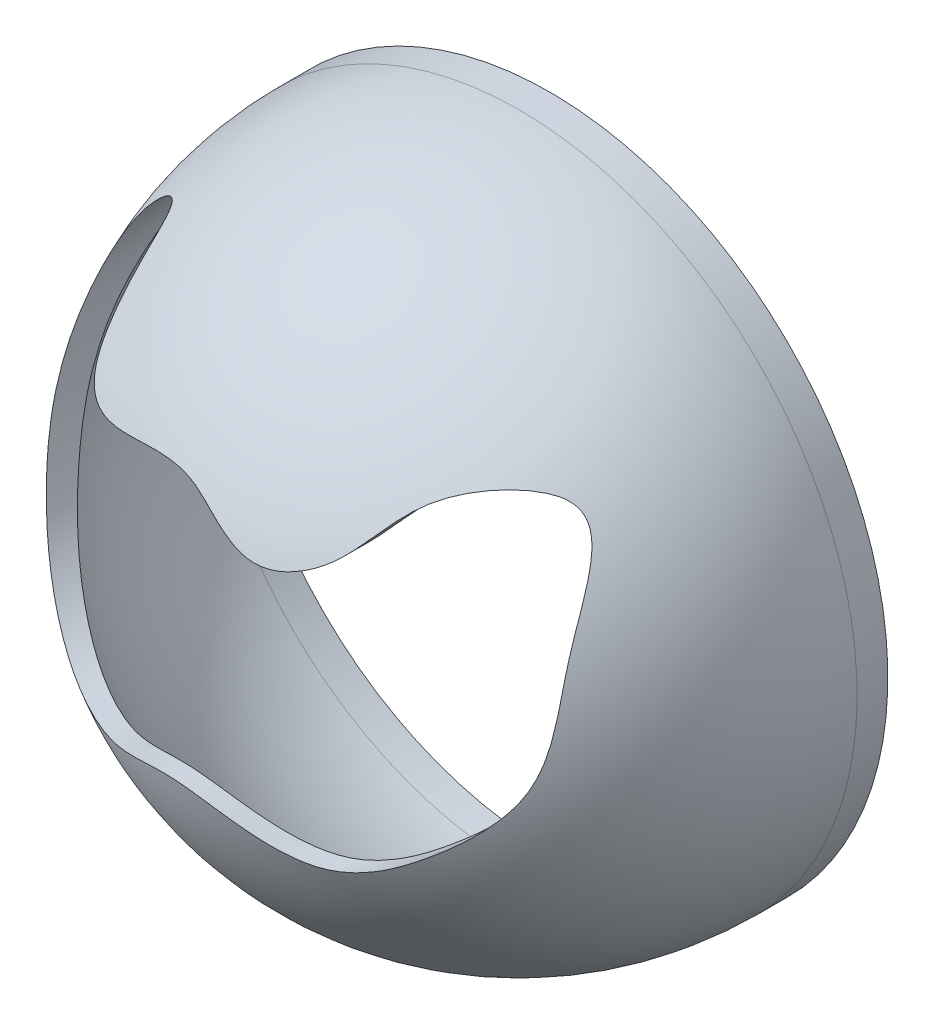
from build123d import *

# Parameters (mm, degrees)
SHELL1_T           = 3
CUT_EXTRUDE1_DEPTH = 70


with BuildPart() as part:
    # Sketch2 → Revolve1 (revolve)
    with BuildSketch(Plane(origin=(0, 0, 0), x_dir=(0, 0, -1), z_dir=(1, 0, 0)), mode=Mode.PRIVATE) as revolve1_sk:
        with BuildLine():
            Line((90.580335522, 0), (147.580335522, 0))
            Line((147.580335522, 0), (147.580335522, 52))
            Line((147.580335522, 52), (142.580335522, 52))
            ThreePointArc((142.580335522, 52), (105.810782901, 36.769552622), (90.580335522, 0))
        make_face()
    revolve(revolve1_sk.sketch.rotate(Axis((0, 0, -90.580335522), (0, 0, 1)), 90), axis=Axis((0, 0, -90.580335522), (0, 0, 1)))

    # Shell1
    shell1_openings = [part.faces().sort_by_distance(p)[0] for p in [
        (0, 0, -147.580335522),
    ]]
    offset(amount=SHELL1_T, openings=shell1_openings, kind=Kind.INTERSECTION)

    # Sketch9 → Cut-Extrude1 (cut)
    with BuildSketch(Plane(origin=(0, 0, -67.580335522), x_dir=(-1, 0, 0), z_dir=(0, 0, -1))):
        with BuildLine():
            add(Edge.make_bspline(
                [(32.08152705, 37.093339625), (29.875407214, 35.919884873), (32.540043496, 20.238702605), (15.878754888, 24.162119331), (4.211917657, 27.048360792), (-6.510640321, 18.068572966), (-18.334163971, 22.685102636), (-23.143372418, 32.685712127), (-39.656872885, 33.769943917), (-41.598020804, 14.134658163), (-41.966856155, -2.745013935), (-29.836762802, -13.863229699), (-17.204331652, -21.408271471), (-6.041287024, -16.095303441), (5.629436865, -13.148394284), (17.322096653, -19.524872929), (33.364707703, -17.582844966), (45.632859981, -4.588174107), (45.830037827, 14.030524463), (44.816132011, 28.023649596), (33.83318943, 38.025064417), (32.08152705, 37.093339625)],
                knots=[0, 0, 0, 0, 0.051096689, 0.094189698, 0.148467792, 0.194376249, 0.235839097, 0.274591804, 0.317068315, 0.383103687, 0.457294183, 0.510351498, 0.56525305, 0.613192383, 0.644405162, 0.701513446, 0.757417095, 0.819695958, 0.89008166, 0.959429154, 1, 1, 1, 1], degree=3))
        make_face()
    extrude(amount=CUT_EXTRUDE1_DEPTH, mode=Mode.SUBTRACT)


solid = part.part
